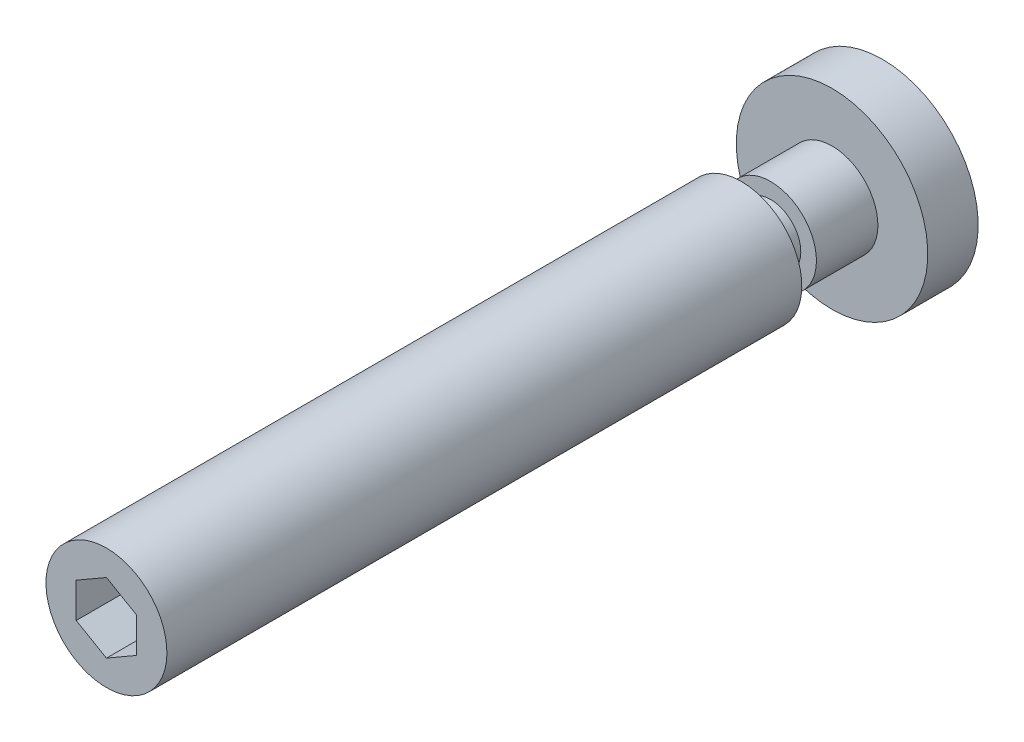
ISO-10303-21;
HEADER;
FILE_DESCRIPTION(('STEP AP214'),'2;1');
FILE_NAME('part.step','',(''),(''),'','','');
FILE_SCHEMA(('AUTOMOTIVE_DESIGN { 1 0 10303 214 1 1 1 1 }'));
ENDSEC;
DATA;
#1=APPLICATION_CONTEXT('core data for automotive mechanical design processes');
#2=APPLICATION_PROTOCOL_DEFINITION('international standard','automotive_design',2000,#1);
#3=PRODUCT_CONTEXT('',#1,'mechanical');
#4=PRODUCT('Part','Part','',(#3));
#5=PRODUCT_RELATED_PRODUCT_CATEGORY('part','',(#4));
#6=PRODUCT_DEFINITION_FORMATION('','',#4);
#7=PRODUCT_DEFINITION_CONTEXT('part definition',#1,'design');
#8=PRODUCT_DEFINITION('design','',#6,#7);
#9=PRODUCT_DEFINITION_SHAPE('','',#8);
#10=(LENGTH_UNIT() NAMED_UNIT(*) SI_UNIT(.MILLI.,.METRE.));
#11=(NAMED_UNIT(*) PLANE_ANGLE_UNIT() SI_UNIT($,.RADIAN.));
#12=(NAMED_UNIT(*) SI_UNIT($,.STERADIAN.) SOLID_ANGLE_UNIT());
#13=UNCERTAINTY_MEASURE_WITH_UNIT(LENGTH_MEASURE(1.E-05),#10,'distance_accuracy_value','');
#14=(GEOMETRIC_REPRESENTATION_CONTEXT(3) GLOBAL_UNCERTAINTY_ASSIGNED_CONTEXT((#13)) GLOBAL_UNIT_ASSIGNED_CONTEXT((#10,
#11,#12)) REPRESENTATION_CONTEXT('',''));
#15=CARTESIAN_POINT('',(0.,0.,0.));
#16=DIRECTION('',(0.,0.,1.));
#17=DIRECTION('',(1.,0.,0.));
#18=AXIS2_PLACEMENT_3D('',#15,#16,#17);
#19=CARTESIAN_POINT('',(0.,0.,0.));
#20=DIRECTION('',(0.,0.,1.));
#21=DIRECTION('',(0.,1.,0.));
#22=AXIS2_PLACEMENT_3D('',#19,#20,#21);
#23=PLANE('',#22);
#24=CARTESIAN_POINT('',(0.,0.,0.));
#25=DIRECTION('',(0.,0.,1.));
#26=DIRECTION('',(0.,1.,0.));
#27=AXIS2_PLACEMENT_3D('',#24,#25,#26);
#28=CIRCLE('',#27,9.5);
#29=CARTESIAN_POINT('',(0.,9.5,0.));
#30=VERTEX_POINT('',#29);
#31=EDGE_CURVE('E9',#30,#30,#28,.T.);
#32=ORIENTED_EDGE('',*,*,#31,.F.);
#33=EDGE_LOOP('',(#32));
#34=FACE_BOUND('',#33,.T.);
#35=ADVANCED_FACE('F14',(#34),#23,.F.);
#36=CARTESIAN_POINT('',(0.,0.,40.));
#37=DIRECTION('',(0.,0.,1.));
#38=DIRECTION('',(0.,1.,0.));
#39=AXIS2_PLACEMENT_3D('',#36,#37,#38);
#40=CYLINDRICAL_SURFACE('',#39,9.5);
#41=CARTESIAN_POINT('',(0.,0.,5.));
#42=DIRECTION('',(0.,0.,1.));
#43=DIRECTION('',(0.,1.,0.));
#44=AXIS2_PLACEMENT_3D('',#41,#42,#43);
#45=CIRCLE('',#44,9.5);
#46=CARTESIAN_POINT('',(0.,9.5,5.));
#47=VERTEX_POINT('',#46);
#48=EDGE_CURVE('E21',#47,#47,#45,.T.);
#49=ORIENTED_EDGE('',*,*,#48,.F.);
#50=EDGE_LOOP('',(#49));
#51=FACE_BOUND('',#50,.T.);
#52=ORIENTED_EDGE('',*,*,#31,.T.);
#53=EDGE_LOOP('',(#52));
#54=FACE_BOUND('',#53,.T.);
#55=ADVANCED_FACE('F142',(#51,#54),#40,.T.);
#56=CARTESIAN_POINT('',(0.,-9.5,5.));
#57=DIRECTION('',(0.,0.,-1.));
#58=DIRECTION('',(0.,-1.,0.));
#59=AXIS2_PLACEMENT_3D('',#56,#57,#58);
#60=PLANE('',#59);
#61=CARTESIAN_POINT('',(0.,0.,5.));
#62=DIRECTION('',(0.,0.,1.));
#63=DIRECTION('',(0.,1.,0.));
#64=AXIS2_PLACEMENT_3D('',#61,#62,#63);
#65=CIRCLE('',#64,4.55);
#66=CARTESIAN_POINT('',(0.,4.55,5.));
#67=VERTEX_POINT('',#66);
#68=EDGE_CURVE('E135',#67,#67,#65,.T.);
#69=ORIENTED_EDGE('',*,*,#68,.F.);
#70=EDGE_LOOP('',(#69));
#71=FACE_BOUND('',#70,.T.);
#72=ORIENTED_EDGE('',*,*,#48,.T.);
#73=EDGE_LOOP('',(#72));
#74=FACE_BOUND('',#73,.T.);
#75=ADVANCED_FACE('F140',(#71,#74),#60,.F.);
#76=CARTESIAN_POINT('',(0.,0.,40.));
#77=DIRECTION('',(0.,0.,1.));
#78=DIRECTION('',(0.,1.,0.));
#79=AXIS2_PLACEMENT_3D('',#76,#77,#78);
#80=CYLINDRICAL_SURFACE('',#79,4.55);
#81=CARTESIAN_POINT('',(0.,0.,11.1));
#82=DIRECTION('',(0.,0.,1.));
#83=DIRECTION('',(0.,1.,0.));
#84=AXIS2_PLACEMENT_3D('',#81,#82,#83);
#85=CIRCLE('',#84,4.55);
#86=CARTESIAN_POINT('',(0.,4.55,11.1));
#87=VERTEX_POINT('',#86);
#88=EDGE_CURVE('E132',#87,#87,#85,.T.);
#89=ORIENTED_EDGE('',*,*,#88,.F.);
#90=EDGE_LOOP('',(#89));
#91=FACE_BOUND('',#90,.T.);
#92=ORIENTED_EDGE('',*,*,#68,.T.);
#93=EDGE_LOOP('',(#92));
#94=FACE_BOUND('',#93,.T.);
#95=ADVANCED_FACE('F165',(#91,#94),#80,.T.);
#96=CARTESIAN_POINT('',(0.,-4.55,11.1));
#97=DIRECTION('',(0.,0.,-1.));
#98=DIRECTION('',(0.,-1.,0.));
#99=AXIS2_PLACEMENT_3D('',#96,#97,#98);
#100=PLANE('',#99);
#101=CARTESIAN_POINT('',(0.,0.,11.1));
#102=DIRECTION('',(0.,0.,1.));
#103=DIRECTION('',(0.,1.,0.));
#104=AXIS2_PLACEMENT_3D('',#101,#102,#103);
#105=CIRCLE('',#104,3.);
#106=CARTESIAN_POINT('',(0.,3.,11.1));
#107=VERTEX_POINT('',#106);
#108=EDGE_CURVE('E129',#107,#107,#105,.T.);
#109=ORIENTED_EDGE('',*,*,#108,.F.);
#110=EDGE_LOOP('',(#109));
#111=FACE_BOUND('',#110,.T.);
#112=ORIENTED_EDGE('',*,*,#88,.T.);
#113=EDGE_LOOP('',(#112));
#114=FACE_BOUND('',#113,.T.);
#115=ADVANCED_FACE('F174',(#111,#114),#100,.F.);
#116=CARTESIAN_POINT('',(0.,0.,40.));
#117=DIRECTION('',(0.,0.,1.));
#118=DIRECTION('',(0.,1.,0.));
#119=AXIS2_PLACEMENT_3D('',#116,#117,#118);
#120=CYLINDRICAL_SURFACE('',#119,3.);
#121=CARTESIAN_POINT('',(0.,0.,14.));
#122=DIRECTION('',(0.,0.,1.));
#123=DIRECTION('',(0.,1.,0.));
#124=AXIS2_PLACEMENT_3D('',#121,#122,#123);
#125=CIRCLE('',#124,3.);
#126=CARTESIAN_POINT('',(0.,3.,14.));
#127=VERTEX_POINT('',#126);
#128=EDGE_CURVE('E126',#127,#127,#125,.T.);
#129=ORIENTED_EDGE('',*,*,#128,.F.);
#130=EDGE_LOOP('',(#129));
#131=FACE_BOUND('',#130,.T.);
#132=ORIENTED_EDGE('',*,*,#108,.T.);
#133=EDGE_LOOP('',(#132));
#134=FACE_BOUND('',#133,.T.);
#135=ADVANCED_FACE('F183',(#131,#134),#120,.T.);
#136=CARTESIAN_POINT('',(0.,-3.,14.));
#137=DIRECTION('',(0.,0.,1.));
#138=DIRECTION('',(0.,1.,0.));
#139=AXIS2_PLACEMENT_3D('',#136,#137,#138);
#140=PLANE('',#139);
#141=CARTESIAN_POINT('',(0.,0.,14.));
#142=DIRECTION('',(0.,0.,1.));
#143=DIRECTION('',(0.,1.,0.));
#144=AXIS2_PLACEMENT_3D('',#141,#142,#143);
#145=CIRCLE('',#144,6.);
#146=CARTESIAN_POINT('',(0.,6.,14.));
#147=VERTEX_POINT('',#146);
#148=EDGE_CURVE('E123',#147,#147,#145,.T.);
#149=ORIENTED_EDGE('',*,*,#148,.F.);
#150=EDGE_LOOP('',(#149));
#151=FACE_BOUND('',#150,.T.);
#152=ORIENTED_EDGE('',*,*,#128,.T.);
#153=EDGE_LOOP('',(#152));
#154=FACE_BOUND('',#153,.T.);
#155=ADVANCED_FACE('F192',(#151,#154),#140,.F.);
#156=CARTESIAN_POINT('',(0.,0.,40.));
#157=DIRECTION('',(0.,0.,1.));
#158=DIRECTION('',(0.,1.,0.));
#159=AXIS2_PLACEMENT_3D('',#156,#157,#158);
#160=CYLINDRICAL_SURFACE('',#159,6.);
#161=CARTESIAN_POINT('',(0.,0.,77.));
#162=DIRECTION('',(0.,0.,1.));
#163=DIRECTION('',(0.,1.,0.));
#164=AXIS2_PLACEMENT_3D('',#161,#162,#163);
#165=CIRCLE('',#164,6.);
#166=CARTESIAN_POINT('',(0.,6.,77.));
#167=VERTEX_POINT('',#166);
#168=EDGE_CURVE('E115',#167,#167,#165,.T.);
#169=ORIENTED_EDGE('',*,*,#168,.F.);
#170=EDGE_LOOP('',(#169));
#171=FACE_BOUND('',#170,.T.);
#172=ORIENTED_EDGE('',*,*,#148,.T.);
#173=EDGE_LOOP('',(#172));
#174=FACE_BOUND('',#173,.T.);
#175=ADVANCED_FACE('F201',(#171,#174),#160,.T.);
#176=CARTESIAN_POINT('',(0.,-6.,77.));
#177=DIRECTION('',(0.,0.,-1.));
#178=DIRECTION('',(0.,-1.,0.));
#179=AXIS2_PLACEMENT_3D('',#176,#177,#178);
#180=PLANE('',#179);
#181=DIRECTION('',(-0.866025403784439,-0.5,0.));
#182=VECTOR('',#181,1.);
#183=CARTESIAN_POINT('',(0.,3.46410161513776,77.));
#184=LINE('',#183,#182);
#185=CARTESIAN_POINT('',(0.,3.46410161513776,77.));
#186=VERTEX_POINT('',#185);
#187=CARTESIAN_POINT('',(-3.,1.73205080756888,77.));
#188=VERTEX_POINT('',#187);
#189=EDGE_CURVE('E102',#186,#188,#184,.T.);
#190=ORIENTED_EDGE('',*,*,#189,.F.);
#191=DIRECTION('',(-0.866025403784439,0.5,0.));
#192=VECTOR('',#191,1.);
#193=CARTESIAN_POINT('',(3.,1.73205080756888,77.));
#194=LINE('',#193,#192);
#195=CARTESIAN_POINT('',(3.,1.73205080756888,77.));
#196=VERTEX_POINT('',#195);
#197=EDGE_CURVE('E28',#196,#186,#194,.T.);
#198=ORIENTED_EDGE('',*,*,#197,.F.);
#199=DIRECTION('',(0.,1.,0.));
#200=VECTOR('',#199,1.);
#201=CARTESIAN_POINT('',(3.,-1.73205080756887,77.));
#202=LINE('',#201,#200);
#203=CARTESIAN_POINT('',(3.,-1.73205080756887,77.));
#204=VERTEX_POINT('',#203);
#205=EDGE_CURVE('E111',#204,#196,#202,.T.);
#206=ORIENTED_EDGE('',*,*,#205,.F.);
#207=DIRECTION('',(0.866025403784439,0.5,0.));
#208=VECTOR('',#207,1.);
#209=CARTESIAN_POINT('',(0.,-3.46410161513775,77.));
#210=LINE('',#209,#208);
#211=CARTESIAN_POINT('',(0.,-3.46410161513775,77.));
#212=VERTEX_POINT('',#211);
#213=EDGE_CURVE('E109',#212,#204,#210,.T.);
#214=ORIENTED_EDGE('',*,*,#213,.F.);
#215=DIRECTION('',(0.866025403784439,-0.5,0.));
#216=VECTOR('',#215,1.);
#217=CARTESIAN_POINT('',(-3.,-1.73205080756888,77.));
#218=LINE('',#217,#216);
#219=CARTESIAN_POINT('',(-3.,-1.73205080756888,77.));
#220=VERTEX_POINT('',#219);
#221=EDGE_CURVE('E76',#220,#212,#218,.T.);
#222=ORIENTED_EDGE('',*,*,#221,.F.);
#223=DIRECTION('',(0.,-1.,0.));
#224=VECTOR('',#223,1.);
#225=CARTESIAN_POINT('',(-3.,1.73205080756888,77.));
#226=LINE('',#225,#224);
#227=EDGE_CURVE('E105',#188,#220,#226,.T.);
#228=ORIENTED_EDGE('',*,*,#227,.F.);
#229=EDGE_LOOP('',(#190,#198,#206,#214,#222,#228));
#230=FACE_BOUND('',#229,.T.);
#231=ORIENTED_EDGE('',*,*,#168,.T.);
#232=EDGE_LOOP('',(#231));
#233=FACE_BOUND('',#232,.T.);
#234=ADVANCED_FACE('F210',(#230,#233),#180,.F.);
#235=CARTESIAN_POINT('',(3.,1.73205080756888,69.));
#236=DIRECTION('',(0.5,0.866025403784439,0.));
#237=DIRECTION('',(-0.866025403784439,0.5,0.));
#238=AXIS2_PLACEMENT_3D('',#235,#236,#237);
#239=PLANE('',#238);
#240=ORIENTED_EDGE('',*,*,#197,.T.);
#241=DIRECTION('',(0.,0.,1.));
#242=VECTOR('',#241,1.);
#243=CARTESIAN_POINT('',(0.,3.46410161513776,69.));
#244=LINE('',#243,#242);
#245=CARTESIAN_POINT('',(0.,3.46410161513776,69.));
#246=VERTEX_POINT('',#245);
#247=EDGE_CURVE('E58',#246,#186,#244,.T.);
#248=ORIENTED_EDGE('',*,*,#247,.F.);
#249=DIRECTION('',(-0.866025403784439,0.5,0.));
#250=VECTOR('',#249,1.);
#251=CARTESIAN_POINT('',(3.,1.73205080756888,69.));
#252=LINE('',#251,#250);
#253=CARTESIAN_POINT('',(3.,1.73205080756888,69.));
#254=VERTEX_POINT('',#253);
#255=EDGE_CURVE('E113',#254,#246,#252,.T.);
#256=ORIENTED_EDGE('',*,*,#255,.F.);
#257=DIRECTION('',(0.,0.,1.));
#258=VECTOR('',#257,1.);
#259=CARTESIAN_POINT('',(3.,1.73205080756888,69.));
#260=LINE('',#259,#258);
#261=EDGE_CURVE('E36',#254,#196,#260,.T.);
#262=ORIENTED_EDGE('',*,*,#261,.T.);
#263=EDGE_LOOP('',(#240,#248,#256,#262));
#264=FACE_BOUND('',#263,.T.);
#265=ADVANCED_FACE('F219',(#264),#239,.F.);
#266=CARTESIAN_POINT('',(3.,-1.73205080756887,69.));
#267=DIRECTION('',(1.,0.,0.));
#268=DIRECTION('',(0.,0.,-1.));
#269=AXIS2_PLACEMENT_3D('',#266,#267,#268);
#270=PLANE('',#269);
#271=ORIENTED_EDGE('',*,*,#205,.T.);
#272=ORIENTED_EDGE('',*,*,#261,.F.);
#273=DIRECTION('',(0.,1.,0.));
#274=VECTOR('',#273,1.);
#275=CARTESIAN_POINT('',(3.,-1.73205080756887,69.));
#276=LINE('',#275,#274);
#277=CARTESIAN_POINT('',(3.,-1.73205080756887,69.));
#278=VERTEX_POINT('',#277);
#279=EDGE_CURVE('E88',#278,#254,#276,.T.);
#280=ORIENTED_EDGE('',*,*,#279,.F.);
#281=DIRECTION('',(0.,0.,1.));
#282=VECTOR('',#281,1.);
#283=CARTESIAN_POINT('',(3.,-1.73205080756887,69.));
#284=LINE('',#283,#282);
#285=EDGE_CURVE('E80',#278,#204,#284,.T.);
#286=ORIENTED_EDGE('',*,*,#285,.T.);
#287=EDGE_LOOP('',(#271,#272,#280,#286));
#288=FACE_BOUND('',#287,.T.);
#289=ADVANCED_FACE('F228',(#288),#270,.F.);
#290=CARTESIAN_POINT('',(0.,-3.46410161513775,69.));
#291=DIRECTION('',(0.5,-0.866025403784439,0.));
#292=DIRECTION('',(0.866025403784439,0.5,0.));
#293=AXIS2_PLACEMENT_3D('',#290,#291,#292);
#294=PLANE('',#293);
#295=ORIENTED_EDGE('',*,*,#213,.T.);
#296=ORIENTED_EDGE('',*,*,#285,.F.);
#297=DIRECTION('',(0.866025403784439,0.5,0.));
#298=VECTOR('',#297,1.);
#299=CARTESIAN_POINT('',(0.,-3.46410161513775,69.));
#300=LINE('',#299,#298);
#301=CARTESIAN_POINT('',(0.,-3.46410161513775,69.));
#302=VERTEX_POINT('',#301);
#303=EDGE_CURVE('E84',#302,#278,#300,.T.);
#304=ORIENTED_EDGE('',*,*,#303,.F.);
#305=DIRECTION('',(0.,0.,1.));
#306=VECTOR('',#305,1.);
#307=CARTESIAN_POINT('',(0.,-3.46410161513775,69.));
#308=LINE('',#307,#306);
#309=EDGE_CURVE('E69',#302,#212,#308,.T.);
#310=ORIENTED_EDGE('',*,*,#309,.T.);
#311=EDGE_LOOP('',(#295,#296,#304,#310));
#312=FACE_BOUND('',#311,.T.);
#313=ADVANCED_FACE('F85',(#312),#294,.F.);
#314=CARTESIAN_POINT('',(-3.,-1.73205080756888,69.));
#315=DIRECTION('',(-0.5,-0.866025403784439,0.));
#316=DIRECTION('',(0.866025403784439,-0.5,0.));
#317=AXIS2_PLACEMENT_3D('',#314,#315,#316);
#318=PLANE('',#317);
#319=ORIENTED_EDGE('',*,*,#221,.T.);
#320=ORIENTED_EDGE('',*,*,#309,.F.);
#321=DIRECTION('',(0.866025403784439,-0.5,0.));
#322=VECTOR('',#321,1.);
#323=CARTESIAN_POINT('',(-3.,-1.73205080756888,69.));
#324=LINE('',#323,#322);
#325=CARTESIAN_POINT('',(-3.,-1.73205080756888,69.));
#326=VERTEX_POINT('',#325);
#327=EDGE_CURVE('E73',#326,#302,#324,.T.);
#328=ORIENTED_EDGE('',*,*,#327,.F.);
#329=DIRECTION('',(0.,0.,1.));
#330=VECTOR('',#329,1.);
#331=CARTESIAN_POINT('',(-3.,-1.73205080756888,69.));
#332=LINE('',#331,#330);
#333=EDGE_CURVE('E81',#326,#220,#332,.T.);
#334=ORIENTED_EDGE('',*,*,#333,.T.);
#335=EDGE_LOOP('',(#319,#320,#328,#334));
#336=FACE_BOUND('',#335,.T.);
#337=ADVANCED_FACE('F71',(#336),#318,.F.);
#338=CARTESIAN_POINT('',(-3.,1.73205080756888,69.));
#339=DIRECTION('',(-1.,0.,0.));
#340=DIRECTION('',(0.,0.,1.));
#341=AXIS2_PLACEMENT_3D('',#338,#339,#340);
#342=PLANE('',#341);
#343=ORIENTED_EDGE('',*,*,#227,.T.);
#344=ORIENTED_EDGE('',*,*,#333,.F.);
#345=DIRECTION('',(0.,-1.,0.));
#346=VECTOR('',#345,1.);
#347=CARTESIAN_POINT('',(-3.,1.73205080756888,69.));
#348=LINE('',#347,#346);
#349=CARTESIAN_POINT('',(-3.,1.73205080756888,69.));
#350=VERTEX_POINT('',#349);
#351=EDGE_CURVE('E94',#350,#326,#348,.T.);
#352=ORIENTED_EDGE('',*,*,#351,.F.);
#353=DIRECTION('',(0.,0.,1.));
#354=VECTOR('',#353,1.);
#355=CARTESIAN_POINT('',(-3.,1.73205080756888,69.));
#356=LINE('',#355,#354);
#357=EDGE_CURVE('E118',#350,#188,#356,.T.);
#358=ORIENTED_EDGE('',*,*,#357,.T.);
#359=EDGE_LOOP('',(#343,#344,#352,#358));
#360=FACE_BOUND('',#359,.T.);
#361=ADVANCED_FACE('F250',(#360),#342,.F.);
#362=CARTESIAN_POINT('',(0.,3.46410161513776,69.));
#363=DIRECTION('',(-0.5,0.866025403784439,0.));
#364=DIRECTION('',(-0.866025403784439,-0.5,0.));
#365=AXIS2_PLACEMENT_3D('',#362,#363,#364);
#366=PLANE('',#365);
#367=ORIENTED_EDGE('',*,*,#189,.T.);
#368=ORIENTED_EDGE('',*,*,#357,.F.);
#369=DIRECTION('',(-0.866025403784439,-0.5,0.));
#370=VECTOR('',#369,1.);
#371=CARTESIAN_POINT('',(0.,3.46410161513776,69.));
#372=LINE('',#371,#370);
#373=EDGE_CURVE('E96',#246,#350,#372,.T.);
#374=ORIENTED_EDGE('',*,*,#373,.F.);
#375=ORIENTED_EDGE('',*,*,#247,.T.);
#376=EDGE_LOOP('',(#367,#368,#374,#375));
#377=FACE_BOUND('',#376,.T.);
#378=ADVANCED_FACE('F258',(#377),#366,.F.);
#379=CARTESIAN_POINT('',(0.,3.46410161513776,69.));
#380=DIRECTION('',(0.,0.,1.));
#381=DIRECTION('',(1.,0.,0.));
#382=AXIS2_PLACEMENT_3D('',#379,#380,#381);
#383=PLANE('',#382);
#384=ORIENTED_EDGE('',*,*,#255,.T.);
#385=ORIENTED_EDGE('',*,*,#373,.T.);
#386=ORIENTED_EDGE('',*,*,#351,.T.);
#387=ORIENTED_EDGE('',*,*,#327,.T.);
#388=ORIENTED_EDGE('',*,*,#303,.T.);
#389=ORIENTED_EDGE('',*,*,#279,.T.);
#390=EDGE_LOOP('',(#384,#385,#386,#387,#388,#389));
#391=FACE_BOUND('',#390,.T.);
#392=ADVANCED_FACE('F91',(#391),#383,.T.);
#393=CLOSED_SHELL('',(#35,#55,#75,#95,#115,#135,#155,#175,#234,#265,#289,#313,#337,#361,#378,#392));
#394=MANIFOLD_SOLID_BREP('B1',#393);
#395=ADVANCED_BREP_SHAPE_REPRESENTATION('',(#18,#394),#14);
#396=SHAPE_DEFINITION_REPRESENTATION(#9,#395);
ENDSEC;
END-ISO-10303-21;
